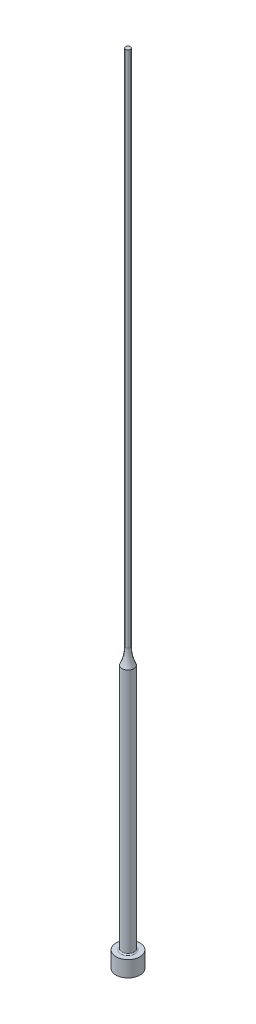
from build123d import *


with BuildPart() as part:
    # Sketch1 → Revolve1 (revolve)
    with BuildSketch(Plane.XY, mode=Mode.PRIVATE) as revolve1_sk:
        with BuildLine():
            Line((0, 0), (3, 0))
            Line((3, 0), (3, 4))
            Line((3, 4), (1.8, 4))
            ThreePointArc((1.8, 4), (1.587867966, 4.087867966), (1.5, 4.3))
            Line((1.5, 4.3), (1.5, 65.853917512))
            ThreePointArc((1.5, 65.853917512), (0.827589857, 67.878679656), (0.6, 70))
            Line((0.6, 70), (0.6, 200))
            Line((0.6, 200), (0, 200))
            Line((0, 200), (0, 0))
        make_face()
    revolve(revolve1_sk.sketch.rotate(Axis((0, 200, 0), (0, -1, 0)), 180), axis=Axis((0, 200, 0), (0, -1, 0)))


solid = part.part
